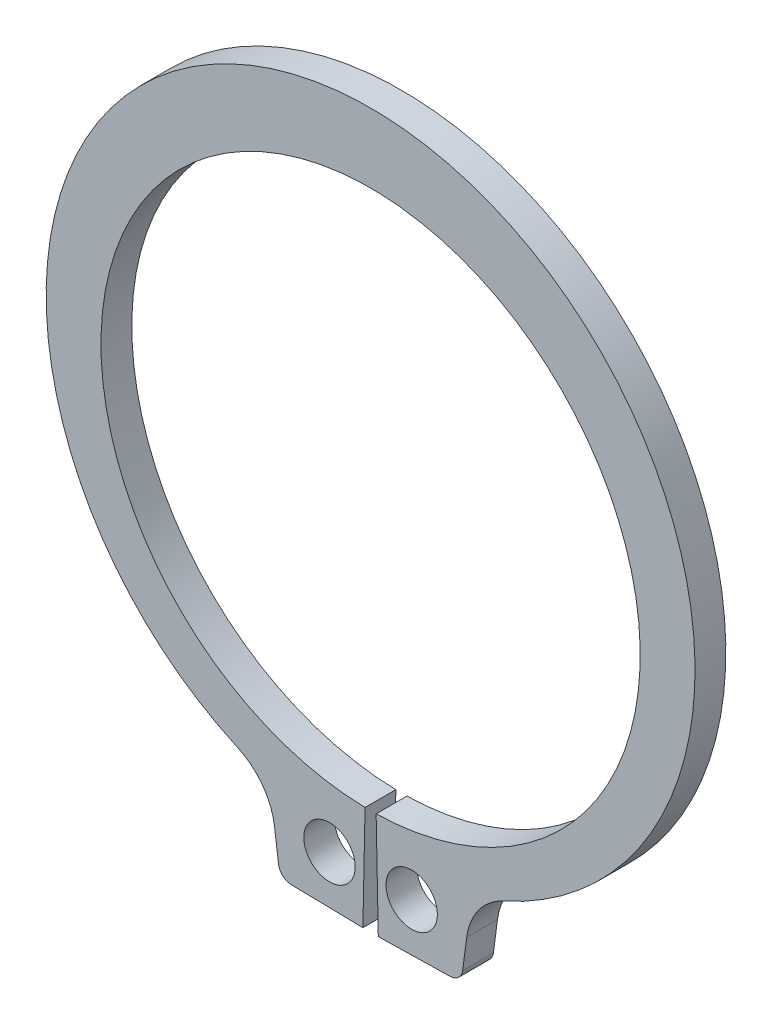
from build123d import *

# Parameters (mm, degrees)
BODYSKE_R  = 1
BODY_DEPTH = 1.2


with BuildPart() as part:
    # BodySke → Body (new body)
    with BuildSketch(Plane.XY):
        with BuildLine():
            Line((0.215753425, -10.497783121), (0.3, -14.596917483))
            Line((0.3, -14.596917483), (3.097594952, -14.539420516))
            ThreePointArc((3.097594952, -14.539420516), (3.42083888, -14.412038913), (3.58304341, -14.104789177))
            Line((3.58304341, -14.104789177), (3.742431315, -12.894117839))
            ThreePointArc((3.742431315, -12.894117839), (4.211164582, -11.738003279), (5.183522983, -10.956446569))
            ThreePointArc((5.183522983, -10.956446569), (0, 13.2), (-5.183522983, -10.956446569))
            ThreePointArc((-5.183522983, -10.956446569), (-4.211164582, -11.738003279), (-3.742431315, -12.894117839))
            Line((-3.742431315, -12.894117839), (-3.58304341, -14.104789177))
            ThreePointArc((-3.58304341, -14.104789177), (-3.42083888, -14.412038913), (-3.097594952, -14.539420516))
            Line((-3.097594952, -14.539420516), (-0.3, -14.596917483))
            Line((-0.3, -14.596917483), (-0.215753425, -10.497783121))
            ThreePointArc((-0.215753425, -10.497783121), (0, 10.5), (0.215753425, -10.497783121))
        make_face()
        with Locations((1.6, -12.699606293)):
            Circle(BODYSKE_R, mode=Mode.SUBTRACT)
        with Locations((-1.6, -12.699606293)):
            Circle(BODYSKE_R, mode=Mode.SUBTRACT)
    extrude(amount=-BODY_DEPTH)


solid = part.part
